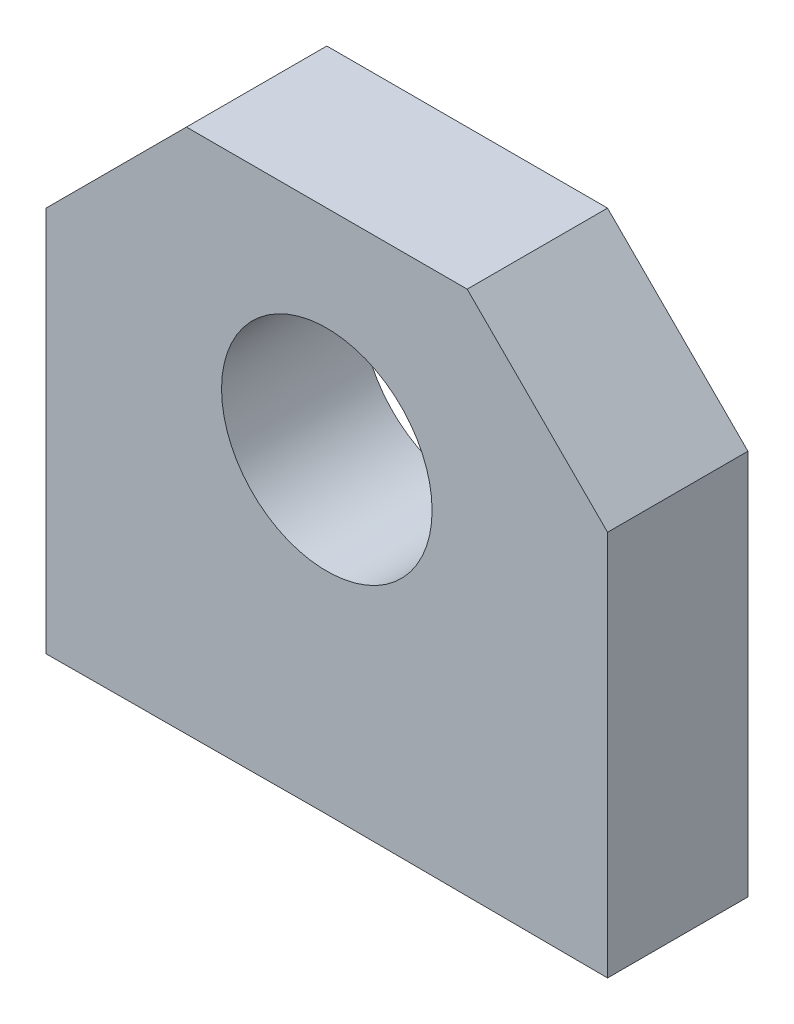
from build123d import *

# Parameters (mm, degrees)
SKETCH_2_R      = 6
EXTRUDE_2_DEPTH = 8


with BuildPart() as part:
    # Sketch 2 → Extrude 2 (new body)
    with BuildSketch(Plane.XY):
        Polygon((0, 8.077158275), (-16, 8), (-16, 30), (-8, 38), (8, 38), (16, 30), (16, 8), align=None)
        with Locations((0, 26.077158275)):
            Circle(SKETCH_2_R, mode=Mode.SUBTRACT)
    extrude(amount=EXTRUDE_2_DEPTH)


solid = part.part
